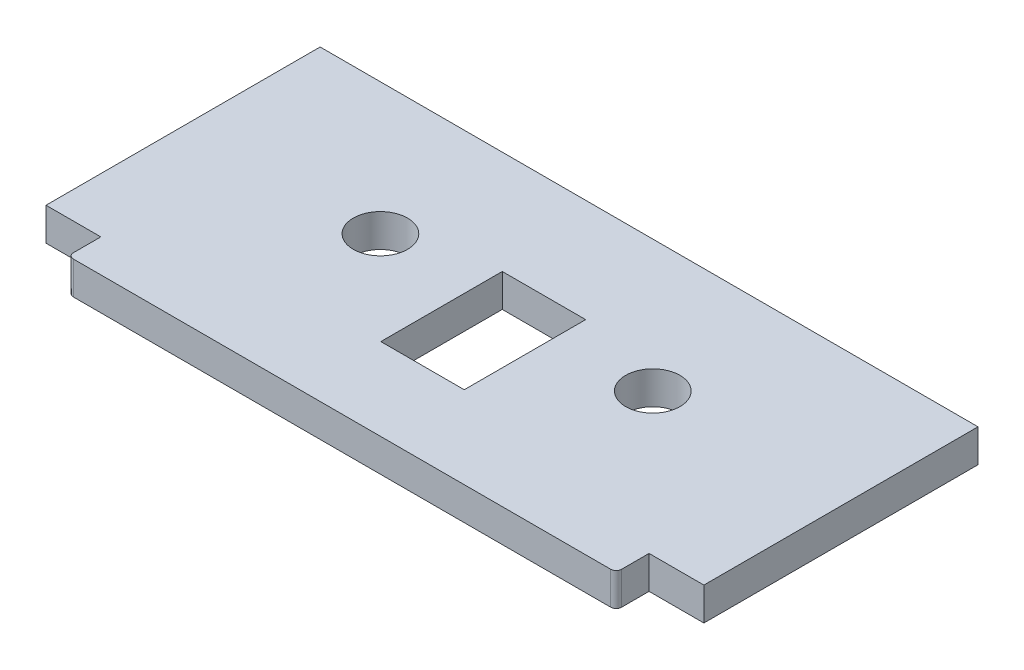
ISO-10303-21;
HEADER;
FILE_DESCRIPTION(('STEP AP214'),'2;1');
FILE_NAME('part.step','',(''),(''),'','','');
FILE_SCHEMA(('AUTOMOTIVE_DESIGN { 1 0 10303 214 1 1 1 1 }'));
ENDSEC;
DATA;
#1=APPLICATION_CONTEXT('core data for automotive mechanical design processes');
#2=APPLICATION_PROTOCOL_DEFINITION('international standard','automotive_design',2000,#1);
#3=PRODUCT_CONTEXT('',#1,'mechanical');
#4=PRODUCT('Part','Part','',(#3));
#5=PRODUCT_RELATED_PRODUCT_CATEGORY('part','',(#4));
#6=PRODUCT_DEFINITION_FORMATION('','',#4);
#7=PRODUCT_DEFINITION_CONTEXT('part definition',#1,'design');
#8=PRODUCT_DEFINITION('design','',#6,#7);
#9=PRODUCT_DEFINITION_SHAPE('','',#8);
#10=(LENGTH_UNIT() NAMED_UNIT(*) SI_UNIT(.MILLI.,.METRE.));
#11=(NAMED_UNIT(*) PLANE_ANGLE_UNIT() SI_UNIT($,.RADIAN.));
#12=(NAMED_UNIT(*) SI_UNIT($,.STERADIAN.) SOLID_ANGLE_UNIT());
#13=UNCERTAINTY_MEASURE_WITH_UNIT(LENGTH_MEASURE(1.E-05),#10,'distance_accuracy_value','');
#14=(GEOMETRIC_REPRESENTATION_CONTEXT(3) GLOBAL_UNCERTAINTY_ASSIGNED_CONTEXT((#13)) GLOBAL_UNIT_ASSIGNED_CONTEXT((#10,
#11,#12)) REPRESENTATION_CONTEXT('',''));
#15=CARTESIAN_POINT('',(0.,0.,0.));
#16=DIRECTION('',(0.,0.,1.));
#17=DIRECTION('',(1.,0.,0.));
#18=AXIS2_PLACEMENT_3D('',#15,#16,#17);
#19=CARTESIAN_POINT('',(0.,6.,0.));
#20=DIRECTION('',(0.,-1.,0.));
#21=DIRECTION('',(0.,0.,-1.));
#22=AXIS2_PLACEMENT_3D('',#19,#20,#21);
#23=PLANE('',#22);
#24=DIRECTION('',(0.,0.,1.));
#25=VECTOR('',#24,1.);
#26=CARTESIAN_POINT('',(-49.6829361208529,6.,33.1559248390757));
#27=LINE('',#26,#25);
#28=CARTESIAN_POINT('',(-49.6829361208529,6.,33.1559248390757));
#29=VERTEX_POINT('',#28);
#30=CARTESIAN_POINT('',(-49.6829361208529,6.,38.1559248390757));
#31=VERTEX_POINT('',#30);
#32=EDGE_CURVE('E223',#29,#31,#27,.T.);
#33=ORIENTED_EDGE('',*,*,#32,.T.);
#34=CARTESIAN_POINT('',(-48.6829361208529,6.,38.1559248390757));
#35=DIRECTION('',(0.,-1.,0.));
#36=DIRECTION('',(0.,0.,-1.));
#37=AXIS2_PLACEMENT_3D('',#34,#35,#36);
#38=CIRCLE('',#37,1.);
#39=CARTESIAN_POINT('',(-48.6829361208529,6.,39.1559248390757));
#40=VERTEX_POINT('',#39);
#41=EDGE_CURVE('E52',#31,#40,#38,.F.);
#42=ORIENTED_EDGE('',*,*,#41,.T.);
#43=DIRECTION('',(1.,0.,0.));
#44=VECTOR('',#43,1.);
#45=CARTESIAN_POINT('',(-49.6829361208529,6.,39.1559248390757));
#46=LINE('',#45,#44);
#47=CARTESIAN_POINT('',(49.3170638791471,6.,39.1559248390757));
#48=VERTEX_POINT('',#47);
#49=EDGE_CURVE('E226',#40,#48,#46,.T.);
#50=ORIENTED_EDGE('',*,*,#49,.T.);
#51=CARTESIAN_POINT('',(49.3170638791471,6.,38.1559248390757));
#52=DIRECTION('',(0.,-1.,0.));
#53=DIRECTION('',(0.,0.,-1.));
#54=AXIS2_PLACEMENT_3D('',#51,#52,#53);
#55=CIRCLE('',#54,1.);
#56=CARTESIAN_POINT('',(50.3170638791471,6.,38.1559248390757));
#57=VERTEX_POINT('',#56);
#58=EDGE_CURVE('E59',#48,#57,#55,.F.);
#59=ORIENTED_EDGE('',*,*,#58,.T.);
#60=DIRECTION('',(0.,0.,-1.));
#61=VECTOR('',#60,1.);
#62=CARTESIAN_POINT('',(50.3170638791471,6.,39.1559248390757));
#63=LINE('',#62,#61);
#64=CARTESIAN_POINT('',(50.3170638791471,6.,33.1559248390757));
#65=VERTEX_POINT('',#64);
#66=EDGE_CURVE('E229',#57,#65,#63,.T.);
#67=ORIENTED_EDGE('',*,*,#66,.T.);
#68=DIRECTION('',(1.,0.,0.));
#69=VECTOR('',#68,1.);
#70=CARTESIAN_POINT('',(50.3170638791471,6.,33.1559248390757));
#71=LINE('',#70,#69);
#72=CARTESIAN_POINT('',(60.3170638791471,6.,33.1559248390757));
#73=VERTEX_POINT('',#72);
#74=EDGE_CURVE('E206',#65,#73,#71,.T.);
#75=ORIENTED_EDGE('',*,*,#74,.T.);
#76=DIRECTION('',(0.,0.,-1.));
#77=VECTOR('',#76,1.);
#78=CARTESIAN_POINT('',(60.3170638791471,6.,-16.8440751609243));
#79=LINE('',#78,#77);
#80=CARTESIAN_POINT('',(60.3170638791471,6.,-16.8440751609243));
#81=VERTEX_POINT('',#80);
#82=EDGE_CURVE('E210',#73,#81,#79,.T.);
#83=ORIENTED_EDGE('',*,*,#82,.T.);
#84=DIRECTION('',(-1.,0.,0.));
#85=VECTOR('',#84,1.);
#86=CARTESIAN_POINT('',(-59.6829361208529,6.,-16.8440751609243));
#87=LINE('',#86,#85);
#88=CARTESIAN_POINT('',(-59.6829361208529,6.,-16.8440751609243));
#89=VERTEX_POINT('',#88);
#90=EDGE_CURVE('E214',#81,#89,#87,.T.);
#91=ORIENTED_EDGE('',*,*,#90,.T.);
#92=DIRECTION('',(0.,0.,1.));
#93=VECTOR('',#92,1.);
#94=CARTESIAN_POINT('',(-59.6829361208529,6.,-16.8440751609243));
#95=LINE('',#94,#93);
#96=CARTESIAN_POINT('',(-59.6829361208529,6.,33.1559248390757));
#97=VERTEX_POINT('',#96);
#98=EDGE_CURVE('E217',#89,#97,#95,.T.);
#99=ORIENTED_EDGE('',*,*,#98,.T.);
#100=DIRECTION('',(1.,0.,0.));
#101=VECTOR('',#100,1.);
#102=CARTESIAN_POINT('',(-59.6829361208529,6.,33.1559248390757));
#103=LINE('',#102,#101);
#104=EDGE_CURVE('E220',#97,#29,#103,.T.);
#105=ORIENTED_EDGE('',*,*,#104,.T.);
#106=EDGE_LOOP('',(#33,#42,#50,#59,#67,#75,#83,#91,#99,#105));
#107=FACE_BOUND('',#106,.T.);
#108=DIRECTION('',(0.,0.,-1.));
#109=VECTOR('',#108,1.);
#110=CARTESIAN_POINT('',(7.60722491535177,6.,24.1559248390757));
#111=LINE('',#110,#109);
#112=CARTESIAN_POINT('',(7.60722491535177,6.,24.1559248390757));
#113=VERTEX_POINT('',#112);
#114=CARTESIAN_POINT('',(7.60722491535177,6.,2.00541423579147));
#115=VERTEX_POINT('',#114);
#116=EDGE_CURVE('E148',#113,#115,#111,.T.);
#117=ORIENTED_EDGE('',*,*,#116,.F.);
#118=DIRECTION('',(1.,0.,0.));
#119=VECTOR('',#118,1.);
#120=CARTESIAN_POINT('',(-7.60722491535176,6.,24.1559248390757));
#121=LINE('',#120,#119);
#122=CARTESIAN_POINT('',(-7.60722491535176,6.,24.1559248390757));
#123=VERTEX_POINT('',#122);
#124=EDGE_CURVE('E180',#123,#113,#121,.T.);
#125=ORIENTED_EDGE('',*,*,#124,.F.);
#126=DIRECTION('',(0.,0.,1.));
#127=VECTOR('',#126,1.);
#128=CARTESIAN_POINT('',(-7.60722491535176,6.,2.00541423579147));
#129=LINE('',#128,#127);
#130=CARTESIAN_POINT('',(-7.60722491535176,6.,2.00541423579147));
#131=VERTEX_POINT('',#130);
#132=EDGE_CURVE('E176',#131,#123,#129,.T.);
#133=ORIENTED_EDGE('',*,*,#132,.F.);
#134=DIRECTION('',(-1.,0.,0.));
#135=VECTOR('',#134,1.);
#136=CARTESIAN_POINT('',(-7.60722491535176,6.,2.00541423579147));
#137=LINE('',#136,#135);
#138=EDGE_CURVE('E159',#115,#131,#137,.T.);
#139=ORIENTED_EDGE('',*,*,#138,.F.);
#140=EDGE_LOOP('',(#117,#125,#133,#139));
#141=FACE_BOUND('',#140,.T.);
#142=CARTESIAN_POINT('',(-24.6829361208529,6.,7.15592483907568));
#143=DIRECTION('',(0.,1.,0.));
#144=DIRECTION('',(0.,0.,1.));
#145=AXIS2_PLACEMENT_3D('',#142,#143,#144);
#146=CIRCLE('',#145,4.95);
#147=CARTESIAN_POINT('',(-24.6829361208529,6.,12.1059248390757));
#148=VERTEX_POINT('',#147);
#149=EDGE_CURVE('E189',#148,#148,#146,.T.);
#150=ORIENTED_EDGE('',*,*,#149,.F.);
#151=EDGE_LOOP('',(#150));
#152=FACE_BOUND('',#151,.T.);
#153=CARTESIAN_POINT('',(25.,6.,7.15592483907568));
#154=DIRECTION('',(0.,1.,0.));
#155=DIRECTION('',(0.,0.,-1.));
#156=AXIS2_PLACEMENT_3D('',#153,#154,#155);
#157=CIRCLE('',#156,4.95);
#158=CARTESIAN_POINT('',(25.,6.,2.20592483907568));
#159=VERTEX_POINT('',#158);
#160=EDGE_CURVE('E536',#159,#159,#157,.T.);
#161=ORIENTED_EDGE('',*,*,#160,.F.);
#162=EDGE_LOOP('',(#161));
#163=FACE_BOUND('',#162,.T.);
#164=ADVANCED_FACE('F43',(#107,#141,#152,#163),#23,.F.);
#165=CARTESIAN_POINT('',(0.,0.,0.));
#166=DIRECTION('',(0.,-1.,0.));
#167=DIRECTION('',(0.,0.,-1.));
#168=AXIS2_PLACEMENT_3D('',#165,#166,#167);
#169=PLANE('',#168);
#170=CARTESIAN_POINT('',(-24.6829361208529,0.,7.15592483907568));
#171=DIRECTION('',(0.,1.,0.));
#172=DIRECTION('',(0.,0.,1.));
#173=AXIS2_PLACEMENT_3D('',#170,#171,#172);
#174=CIRCLE('',#173,4.95);
#175=CARTESIAN_POINT('',(-24.6829361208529,0.,12.1059248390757));
#176=VERTEX_POINT('',#175);
#177=EDGE_CURVE('E544',#176,#176,#174,.T.);
#178=ORIENTED_EDGE('',*,*,#177,.T.);
#179=EDGE_LOOP('',(#178));
#180=FACE_BOUND('',#179,.T.);
#181=DIRECTION('',(1.,0.,0.));
#182=VECTOR('',#181,1.);
#183=CARTESIAN_POINT('',(-49.6829361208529,0.,39.1559248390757));
#184=LINE('',#183,#182);
#185=CARTESIAN_POINT('',(-48.6829361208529,0.,39.1559248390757));
#186=VERTEX_POINT('',#185);
#187=CARTESIAN_POINT('',(49.3170638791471,0.,39.1559248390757));
#188=VERTEX_POINT('',#187);
#189=EDGE_CURVE('E251',#186,#188,#184,.T.);
#190=ORIENTED_EDGE('',*,*,#189,.F.);
#191=CARTESIAN_POINT('',(-48.6829361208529,0.,38.1559248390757));
#192=DIRECTION('',(0.,-1.,0.));
#193=DIRECTION('',(0.,0.,-1.));
#194=AXIS2_PLACEMENT_3D('',#191,#192,#193);
#195=CIRCLE('',#194,1.);
#196=CARTESIAN_POINT('',(-49.6829361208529,0.,38.1559248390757));
#197=VERTEX_POINT('',#196);
#198=EDGE_CURVE('E290',#186,#197,#195,.T.);
#199=ORIENTED_EDGE('',*,*,#198,.T.);
#200=DIRECTION('',(0.,0.,1.));
#201=VECTOR('',#200,1.);
#202=CARTESIAN_POINT('',(-49.6829361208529,0.,33.1559248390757));
#203=LINE('',#202,#201);
#204=CARTESIAN_POINT('',(-49.6829361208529,0.,33.1559248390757));
#205=VERTEX_POINT('',#204);
#206=EDGE_CURVE('E248',#205,#197,#203,.T.);
#207=ORIENTED_EDGE('',*,*,#206,.F.);
#208=DIRECTION('',(1.,0.,0.));
#209=VECTOR('',#208,1.);
#210=CARTESIAN_POINT('',(-59.6829361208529,0.,33.1559248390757));
#211=LINE('',#210,#209);
#212=CARTESIAN_POINT('',(-59.6829361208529,0.,33.1559248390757));
#213=VERTEX_POINT('',#212);
#214=EDGE_CURVE('E245',#213,#205,#211,.T.);
#215=ORIENTED_EDGE('',*,*,#214,.F.);
#216=DIRECTION('',(0.,0.,1.));
#217=VECTOR('',#216,1.);
#218=CARTESIAN_POINT('',(-59.6829361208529,0.,-16.8440751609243));
#219=LINE('',#218,#217);
#220=CARTESIAN_POINT('',(-59.6829361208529,0.,-16.8440751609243));
#221=VERTEX_POINT('',#220);
#222=EDGE_CURVE('E242',#221,#213,#219,.T.);
#223=ORIENTED_EDGE('',*,*,#222,.F.);
#224=DIRECTION('',(-1.,0.,0.));
#225=VECTOR('',#224,1.);
#226=CARTESIAN_POINT('',(-59.6829361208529,0.,-16.8440751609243));
#227=LINE('',#226,#225);
#228=CARTESIAN_POINT('',(60.3170638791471,0.,-16.8440751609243));
#229=VERTEX_POINT('',#228);
#230=EDGE_CURVE('E239',#229,#221,#227,.T.);
#231=ORIENTED_EDGE('',*,*,#230,.F.);
#232=DIRECTION('',(0.,0.,-1.));
#233=VECTOR('',#232,1.);
#234=CARTESIAN_POINT('',(60.3170638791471,0.,-16.8440751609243));
#235=LINE('',#234,#233);
#236=CARTESIAN_POINT('',(60.3170638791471,0.,33.1559248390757));
#237=VERTEX_POINT('',#236);
#238=EDGE_CURVE('E236',#237,#229,#235,.T.);
#239=ORIENTED_EDGE('',*,*,#238,.F.);
#240=DIRECTION('',(1.,0.,0.));
#241=VECTOR('',#240,1.);
#242=CARTESIAN_POINT('',(50.3170638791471,0.,33.1559248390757));
#243=LINE('',#242,#241);
#244=CARTESIAN_POINT('',(50.3170638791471,0.,33.1559248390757));
#245=VERTEX_POINT('',#244);
#246=EDGE_CURVE('E170',#245,#237,#243,.T.);
#247=ORIENTED_EDGE('',*,*,#246,.F.);
#248=DIRECTION('',(0.,0.,-1.));
#249=VECTOR('',#248,1.);
#250=CARTESIAN_POINT('',(50.3170638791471,0.,39.1559248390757));
#251=LINE('',#250,#249);
#252=CARTESIAN_POINT('',(50.3170638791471,0.,38.1559248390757));
#253=VERTEX_POINT('',#252);
#254=EDGE_CURVE('E211',#253,#245,#251,.T.);
#255=ORIENTED_EDGE('',*,*,#254,.F.);
#256=CARTESIAN_POINT('',(49.3170638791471,0.,38.1559248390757));
#257=DIRECTION('',(0.,-1.,0.));
#258=DIRECTION('',(0.,0.,-1.));
#259=AXIS2_PLACEMENT_3D('',#256,#257,#258);
#260=CIRCLE('',#259,1.);
#261=EDGE_CURVE('E287',#253,#188,#260,.T.);
#262=ORIENTED_EDGE('',*,*,#261,.T.);
#263=EDGE_LOOP('',(#190,#199,#207,#215,#223,#231,#239,#247,#255,#262));
#264=FACE_BOUND('',#263,.T.);
#265=DIRECTION('',(1.,0.,0.));
#266=VECTOR('',#265,1.);
#267=CARTESIAN_POINT('',(-7.60722491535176,0.,24.1559248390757));
#268=LINE('',#267,#266);
#269=CARTESIAN_POINT('',(-7.60722491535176,0.,24.1559248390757));
#270=VERTEX_POINT('',#269);
#271=CARTESIAN_POINT('',(7.60722491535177,0.,24.1559248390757));
#272=VERTEX_POINT('',#271);
#273=EDGE_CURVE('E160',#270,#272,#268,.T.);
#274=ORIENTED_EDGE('',*,*,#273,.T.);
#275=DIRECTION('',(0.,0.,-1.));
#276=VECTOR('',#275,1.);
#277=CARTESIAN_POINT('',(7.60722491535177,0.,2.00541423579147));
#278=LINE('',#277,#276);
#279=CARTESIAN_POINT('',(7.60722491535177,0.,2.00541423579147));
#280=VERTEX_POINT('',#279);
#281=EDGE_CURVE('E186',#272,#280,#278,.T.);
#282=ORIENTED_EDGE('',*,*,#281,.T.);
#283=DIRECTION('',(-1.,0.,0.));
#284=VECTOR('',#283,1.);
#285=CARTESIAN_POINT('',(-7.60722491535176,0.,2.00541423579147));
#286=LINE('',#285,#284);
#287=CARTESIAN_POINT('',(-7.60722491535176,0.,2.00541423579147));
#288=VERTEX_POINT('',#287);
#289=EDGE_CURVE('E167',#280,#288,#286,.T.);
#290=ORIENTED_EDGE('',*,*,#289,.T.);
#291=DIRECTION('',(0.,0.,1.));
#292=VECTOR('',#291,1.);
#293=CARTESIAN_POINT('',(-7.60722491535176,0.,18.1559248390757));
#294=LINE('',#293,#292);
#295=EDGE_CURVE('E192',#288,#270,#294,.T.);
#296=ORIENTED_EDGE('',*,*,#295,.T.);
#297=EDGE_LOOP('',(#274,#282,#290,#296));
#298=FACE_BOUND('',#297,.T.);
#299=CARTESIAN_POINT('',(25.,0.,7.15592483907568));
#300=DIRECTION('',(0.,1.,0.));
#301=DIRECTION('',(0.,0.,-1.));
#302=AXIS2_PLACEMENT_3D('',#299,#300,#301);
#303=CIRCLE('',#302,4.95);
#304=CARTESIAN_POINT('',(25.,0.,2.20592483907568));
#305=VERTEX_POINT('',#304);
#306=EDGE_CURVE('E539',#305,#305,#303,.T.);
#307=ORIENTED_EDGE('',*,*,#306,.T.);
#308=EDGE_LOOP('',(#307));
#309=FACE_BOUND('',#308,.T.);
#310=ADVANCED_FACE('F308',(#180,#264,#298,#309),#169,.T.);
#311=CARTESIAN_POINT('',(50.3170638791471,6.,33.1559248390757));
#312=DIRECTION('',(0.,0.,-1.));
#313=DIRECTION('',(-1.,0.,0.));
#314=AXIS2_PLACEMENT_3D('',#311,#312,#313);
#315=PLANE('',#314);
#316=ORIENTED_EDGE('',*,*,#246,.T.);
#317=DIRECTION('',(0.,-1.,0.));
#318=VECTOR('',#317,1.);
#319=CARTESIAN_POINT('',(60.3170638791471,6.,33.1559248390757));
#320=LINE('',#319,#318);
#321=EDGE_CURVE('E276',#73,#237,#320,.T.);
#322=ORIENTED_EDGE('',*,*,#321,.F.);
#323=ORIENTED_EDGE('',*,*,#74,.F.);
#324=DIRECTION('',(0.,-1.,0.));
#325=VECTOR('',#324,1.);
#326=CARTESIAN_POINT('',(50.3170638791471,6.,33.1559248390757));
#327=LINE('',#326,#325);
#328=EDGE_CURVE('E232',#65,#245,#327,.T.);
#329=ORIENTED_EDGE('',*,*,#328,.T.);
#330=EDGE_LOOP('',(#316,#322,#323,#329));
#331=FACE_BOUND('',#330,.T.);
#332=ADVANCED_FACE('F333',(#331),#315,.F.);
#333=CARTESIAN_POINT('',(60.3170638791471,6.,-16.8440751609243));
#334=DIRECTION('',(-1.,0.,0.));
#335=DIRECTION('',(0.,0.,1.));
#336=AXIS2_PLACEMENT_3D('',#333,#334,#335);
#337=PLANE('',#336);
#338=ORIENTED_EDGE('',*,*,#238,.T.);
#339=DIRECTION('',(0.,-1.,0.));
#340=VECTOR('',#339,1.);
#341=CARTESIAN_POINT('',(60.3170638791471,6.,-16.8440751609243));
#342=LINE('',#341,#340);
#343=EDGE_CURVE('E272',#81,#229,#342,.T.);
#344=ORIENTED_EDGE('',*,*,#343,.F.);
#345=ORIENTED_EDGE('',*,*,#82,.F.);
#346=ORIENTED_EDGE('',*,*,#321,.T.);
#347=EDGE_LOOP('',(#338,#344,#345,#346));
#348=FACE_BOUND('',#347,.T.);
#349=ADVANCED_FACE('F328',(#348),#337,.F.);
#350=CARTESIAN_POINT('',(-59.6829361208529,6.,-16.8440751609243));
#351=DIRECTION('',(0.,0.,1.));
#352=DIRECTION('',(1.,0.,0.));
#353=AXIS2_PLACEMENT_3D('',#350,#351,#352);
#354=PLANE('',#353);
#355=ORIENTED_EDGE('',*,*,#230,.T.);
#356=DIRECTION('',(0.,-1.,0.));
#357=VECTOR('',#356,1.);
#358=CARTESIAN_POINT('',(-59.6829361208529,6.,-16.8440751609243));
#359=LINE('',#358,#357);
#360=EDGE_CURVE('E268',#89,#221,#359,.T.);
#361=ORIENTED_EDGE('',*,*,#360,.F.);
#362=ORIENTED_EDGE('',*,*,#90,.F.);
#363=ORIENTED_EDGE('',*,*,#343,.T.);
#364=EDGE_LOOP('',(#355,#361,#362,#363));
#365=FACE_BOUND('',#364,.T.);
#366=ADVANCED_FACE('F325',(#365),#354,.F.);
#367=CARTESIAN_POINT('',(-59.6829361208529,6.,-16.8440751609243));
#368=DIRECTION('',(1.,0.,0.));
#369=DIRECTION('',(0.,0.,-1.));
#370=AXIS2_PLACEMENT_3D('',#367,#368,#369);
#371=PLANE('',#370);
#372=ORIENTED_EDGE('',*,*,#222,.T.);
#373=DIRECTION('',(0.,-1.,0.));
#374=VECTOR('',#373,1.);
#375=CARTESIAN_POINT('',(-59.6829361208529,6.,33.1559248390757));
#376=LINE('',#375,#374);
#377=EDGE_CURVE('E264',#97,#213,#376,.T.);
#378=ORIENTED_EDGE('',*,*,#377,.F.);
#379=ORIENTED_EDGE('',*,*,#98,.F.);
#380=ORIENTED_EDGE('',*,*,#360,.T.);
#381=EDGE_LOOP('',(#372,#378,#379,#380));
#382=FACE_BOUND('',#381,.T.);
#383=ADVANCED_FACE('F320',(#382),#371,.F.);
#384=CARTESIAN_POINT('',(-59.6829361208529,6.,33.1559248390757));
#385=DIRECTION('',(0.,0.,-1.));
#386=DIRECTION('',(-1.,0.,0.));
#387=AXIS2_PLACEMENT_3D('',#384,#385,#386);
#388=PLANE('',#387);
#389=ORIENTED_EDGE('',*,*,#214,.T.);
#390=DIRECTION('',(0.,-1.,0.));
#391=VECTOR('',#390,1.);
#392=CARTESIAN_POINT('',(-49.6829361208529,6.,33.1559248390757));
#393=LINE('',#392,#391);
#394=EDGE_CURVE('E260',#29,#205,#393,.T.);
#395=ORIENTED_EDGE('',*,*,#394,.F.);
#396=ORIENTED_EDGE('',*,*,#104,.F.);
#397=ORIENTED_EDGE('',*,*,#377,.T.);
#398=EDGE_LOOP('',(#389,#395,#396,#397));
#399=FACE_BOUND('',#398,.T.);
#400=ADVANCED_FACE('F315',(#399),#388,.F.);
#401=CARTESIAN_POINT('',(-49.6829361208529,6.,33.1559248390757));
#402=DIRECTION('',(1.,0.,0.));
#403=DIRECTION('',(0.,0.,-1.));
#404=AXIS2_PLACEMENT_3D('',#401,#402,#403);
#405=PLANE('',#404);
#406=ORIENTED_EDGE('',*,*,#206,.T.);
#407=DIRECTION('',(0.,-1.,0.));
#408=VECTOR('',#407,1.);
#409=CARTESIAN_POINT('',(-49.6829361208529,6.,38.1559248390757));
#410=LINE('',#409,#408);
#411=EDGE_CURVE('E67',#197,#31,#410,.F.);
#412=ORIENTED_EDGE('',*,*,#411,.T.);
#413=ORIENTED_EDGE('',*,*,#32,.F.);
#414=ORIENTED_EDGE('',*,*,#394,.T.);
#415=EDGE_LOOP('',(#406,#412,#413,#414));
#416=FACE_BOUND('',#415,.T.);
#417=ADVANCED_FACE('F311',(#416),#405,.F.);
#418=CARTESIAN_POINT('',(-49.6829361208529,6.,39.1559248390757));
#419=DIRECTION('',(0.,0.,-1.));
#420=DIRECTION('',(-1.,0.,0.));
#421=AXIS2_PLACEMENT_3D('',#418,#419,#420);
#422=PLANE('',#421);
#423=ORIENTED_EDGE('',*,*,#49,.F.);
#424=DIRECTION('',(0.,-1.,0.));
#425=VECTOR('',#424,1.);
#426=CARTESIAN_POINT('',(-48.6829361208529,6.,39.1559248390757));
#427=LINE('',#426,#425);
#428=EDGE_CURVE('E283',#40,#186,#427,.T.);
#429=ORIENTED_EDGE('',*,*,#428,.T.);
#430=ORIENTED_EDGE('',*,*,#189,.T.);
#431=DIRECTION('',(0.,-1.,0.));
#432=VECTOR('',#431,1.);
#433=CARTESIAN_POINT('',(49.3170638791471,6.,39.1559248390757));
#434=LINE('',#433,#432);
#435=EDGE_CURVE('E280',#188,#48,#434,.F.);
#436=ORIENTED_EDGE('',*,*,#435,.T.);
#437=EDGE_LOOP('',(#423,#429,#430,#436));
#438=FACE_BOUND('',#437,.T.);
#439=ADVANCED_FACE('F302',(#438),#422,.F.);
#440=CARTESIAN_POINT('',(50.3170638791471,6.,39.1559248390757));
#441=DIRECTION('',(-1.,0.,0.));
#442=DIRECTION('',(0.,0.,1.));
#443=AXIS2_PLACEMENT_3D('',#440,#441,#442);
#444=PLANE('',#443);
#445=ORIENTED_EDGE('',*,*,#66,.F.);
#446=DIRECTION('',(0.,-1.,0.));
#447=VECTOR('',#446,1.);
#448=CARTESIAN_POINT('',(50.3170638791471,6.,38.1559248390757));
#449=LINE('',#448,#447);
#450=EDGE_CURVE('E11',#57,#253,#449,.T.);
#451=ORIENTED_EDGE('',*,*,#450,.T.);
#452=ORIENTED_EDGE('',*,*,#254,.T.);
#453=ORIENTED_EDGE('',*,*,#328,.F.);
#454=EDGE_LOOP('',(#445,#451,#452,#453));
#455=FACE_BOUND('',#454,.T.);
#456=ADVANCED_FACE('F337',(#455),#444,.F.);
#457=CARTESIAN_POINT('',(7.60722491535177,6.,2.00541423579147));
#458=DIRECTION('',(-1.,0.,0.));
#459=DIRECTION('',(0.,0.,1.));
#460=AXIS2_PLACEMENT_3D('',#457,#458,#459);
#461=PLANE('',#460);
#462=ORIENTED_EDGE('',*,*,#281,.F.);
#463=DIRECTION('',(0.,-1.,0.));
#464=VECTOR('',#463,1.);
#465=CARTESIAN_POINT('',(7.60722491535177,6.,24.1559248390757));
#466=LINE('',#465,#464);
#467=EDGE_CURVE('E154',#113,#272,#466,.T.);
#468=ORIENTED_EDGE('',*,*,#467,.F.);
#469=ORIENTED_EDGE('',*,*,#116,.T.);
#470=DIRECTION('',(0.,-1.,0.));
#471=VECTOR('',#470,1.);
#472=CARTESIAN_POINT('',(7.60722491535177,6.,2.00541423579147));
#473=LINE('',#472,#471);
#474=EDGE_CURVE('E152',#115,#280,#473,.T.);
#475=ORIENTED_EDGE('',*,*,#474,.T.);
#476=EDGE_LOOP('',(#462,#468,#469,#475));
#477=FACE_BOUND('',#476,.T.);
#478=ADVANCED_FACE('F151',(#477),#461,.T.);
#479=CARTESIAN_POINT('',(-7.60722491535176,6.,2.00541423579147));
#480=DIRECTION('',(0.,0.,1.));
#481=DIRECTION('',(1.,0.,0.));
#482=AXIS2_PLACEMENT_3D('',#479,#480,#481);
#483=PLANE('',#482);
#484=ORIENTED_EDGE('',*,*,#289,.F.);
#485=ORIENTED_EDGE('',*,*,#474,.F.);
#486=ORIENTED_EDGE('',*,*,#138,.T.);
#487=DIRECTION('',(0.,-1.,0.));
#488=VECTOR('',#487,1.);
#489=CARTESIAN_POINT('',(-7.60722491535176,6.,2.00541423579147));
#490=LINE('',#489,#488);
#491=EDGE_CURVE('E171',#131,#288,#490,.T.);
#492=ORIENTED_EDGE('',*,*,#491,.T.);
#493=EDGE_LOOP('',(#484,#485,#486,#492));
#494=FACE_BOUND('',#493,.T.);
#495=ADVANCED_FACE('F163',(#494),#483,.T.);
#496=CARTESIAN_POINT('',(-7.60722491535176,6.,18.1559248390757));
#497=DIRECTION('',(1.,0.,0.));
#498=DIRECTION('',(0.,0.,-1.));
#499=AXIS2_PLACEMENT_3D('',#496,#497,#498);
#500=PLANE('',#499);
#501=ORIENTED_EDGE('',*,*,#295,.F.);
#502=ORIENTED_EDGE('',*,*,#491,.F.);
#503=ORIENTED_EDGE('',*,*,#132,.T.);
#504=DIRECTION('',(0.,-1.,0.));
#505=VECTOR('',#504,1.);
#506=CARTESIAN_POINT('',(-7.60722491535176,6.,24.1559248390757));
#507=LINE('',#506,#505);
#508=EDGE_CURVE('E201',#123,#270,#507,.T.);
#509=ORIENTED_EDGE('',*,*,#508,.T.);
#510=EDGE_LOOP('',(#501,#502,#503,#509));
#511=FACE_BOUND('',#510,.T.);
#512=ADVANCED_FACE('F414',(#511),#500,.T.);
#513=CARTESIAN_POINT('',(-7.60722491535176,6.,24.1559248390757));
#514=DIRECTION('',(0.,0.,-1.));
#515=DIRECTION('',(-1.,0.,0.));
#516=AXIS2_PLACEMENT_3D('',#513,#514,#515);
#517=PLANE('',#516);
#518=ORIENTED_EDGE('',*,*,#273,.F.);
#519=ORIENTED_EDGE('',*,*,#508,.F.);
#520=ORIENTED_EDGE('',*,*,#124,.T.);
#521=ORIENTED_EDGE('',*,*,#467,.T.);
#522=EDGE_LOOP('',(#518,#519,#520,#521));
#523=FACE_BOUND('',#522,.T.);
#524=ADVANCED_FACE('F420',(#523),#517,.T.);
#525=CARTESIAN_POINT('',(-24.6829361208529,6.,7.15592483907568));
#526=DIRECTION('',(0.,-1.,0.));
#527=DIRECTION('',(0.,0.,-1.));
#528=AXIS2_PLACEMENT_3D('',#525,#526,#527);
#529=CYLINDRICAL_SURFACE('',#528,4.95);
#530=ORIENTED_EDGE('',*,*,#149,.T.);
#531=EDGE_LOOP('',(#530));
#532=FACE_BOUND('',#531,.T.);
#533=ORIENTED_EDGE('',*,*,#177,.F.);
#534=EDGE_LOOP('',(#533));
#535=FACE_BOUND('',#534,.T.);
#536=ADVANCED_FACE('F428',(#532,#535),#529,.F.);
#537=CARTESIAN_POINT('',(25.,6.,7.15592483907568));
#538=DIRECTION('',(0.,-1.,0.));
#539=DIRECTION('',(0.,0.,-1.));
#540=AXIS2_PLACEMENT_3D('',#537,#538,#539);
#541=CYLINDRICAL_SURFACE('',#540,4.95);
#542=ORIENTED_EDGE('',*,*,#160,.T.);
#543=EDGE_LOOP('',(#542));
#544=FACE_BOUND('',#543,.T.);
#545=ORIENTED_EDGE('',*,*,#306,.F.);
#546=EDGE_LOOP('',(#545));
#547=FACE_BOUND('',#546,.T.);
#548=ADVANCED_FACE('F344',(#544,#547),#541,.F.);
#549=CARTESIAN_POINT('',(-48.6829361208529,6.,38.1559248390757));
#550=DIRECTION('',(0.,-1.,0.));
#551=DIRECTION('',(0.,0.,-1.));
#552=AXIS2_PLACEMENT_3D('',#549,#550,#551);
#553=CYLINDRICAL_SURFACE('',#552,1.);
#554=ORIENTED_EDGE('',*,*,#41,.F.);
#555=ORIENTED_EDGE('',*,*,#411,.F.);
#556=ORIENTED_EDGE('',*,*,#198,.F.);
#557=ORIENTED_EDGE('',*,*,#428,.F.);
#558=EDGE_LOOP('',(#554,#555,#556,#557));
#559=FACE_BOUND('',#558,.T.);
#560=ADVANCED_FACE('F305',(#559),#553,.T.);
#561=CARTESIAN_POINT('',(49.3170638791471,6.,38.1559248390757));
#562=DIRECTION('',(0.,-1.,0.));
#563=DIRECTION('',(0.,0.,-1.));
#564=AXIS2_PLACEMENT_3D('',#561,#562,#563);
#565=CYLINDRICAL_SURFACE('',#564,1.);
#566=ORIENTED_EDGE('',*,*,#58,.F.);
#567=ORIENTED_EDGE('',*,*,#435,.F.);
#568=ORIENTED_EDGE('',*,*,#261,.F.);
#569=ORIENTED_EDGE('',*,*,#450,.F.);
#570=EDGE_LOOP('',(#566,#567,#568,#569));
#571=FACE_BOUND('',#570,.T.);
#572=ADVANCED_FACE('F45',(#571),#565,.T.);
#573=CLOSED_SHELL('',(#164,#310,#332,#349,#366,#383,#400,#417,#439,#456,#478,#495,#512,#524,
#536,#548,#560,#572));
#574=MANIFOLD_SOLID_BREP('B2',#573);
#575=ADVANCED_BREP_SHAPE_REPRESENTATION('',(#18,#574),#14);
#576=SHAPE_DEFINITION_REPRESENTATION(#9,#575);
ENDSEC;
END-ISO-10303-21;
